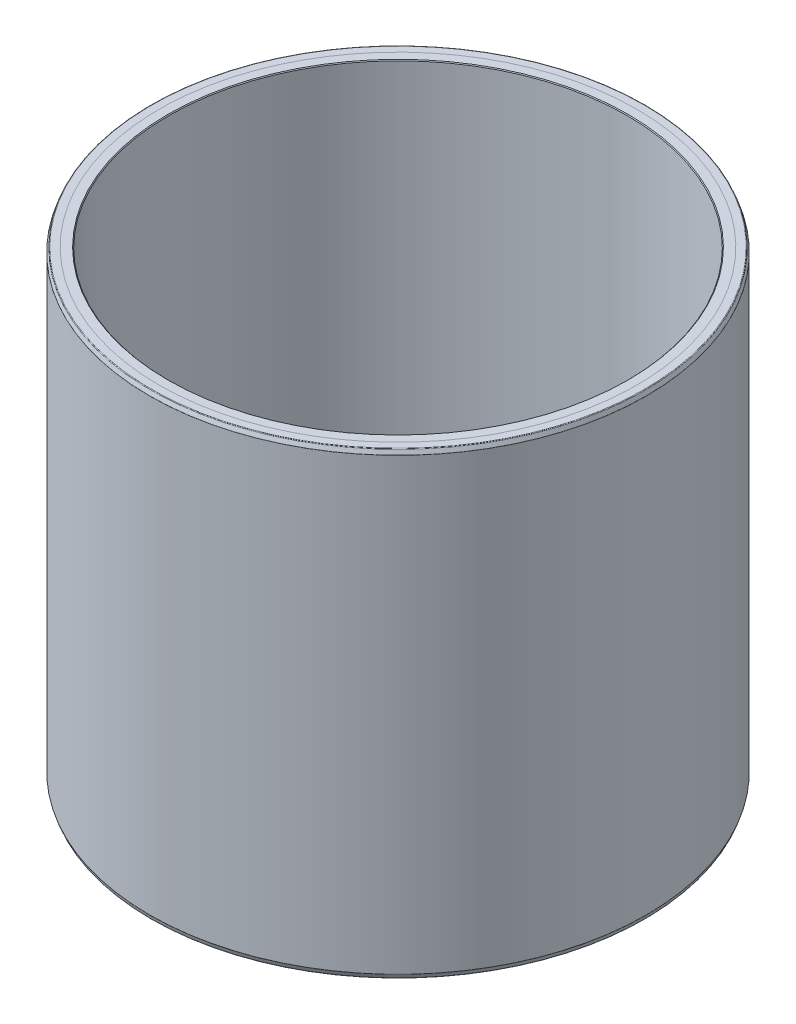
ISO-10303-21;
HEADER;
FILE_DESCRIPTION(('STEP AP214'),'2;1');
FILE_NAME('part.step','',(''),(''),'','','');
FILE_SCHEMA(('AUTOMOTIVE_DESIGN { 1 0 10303 214 1 1 1 1 }'));
ENDSEC;
DATA;
#1=APPLICATION_CONTEXT('core data for automotive mechanical design processes');
#2=APPLICATION_PROTOCOL_DEFINITION('international standard','automotive_design',2000,#1);
#3=PRODUCT_CONTEXT('',#1,'mechanical');
#4=PRODUCT('Part','Part','',(#3));
#5=PRODUCT_RELATED_PRODUCT_CATEGORY('part','',(#4));
#6=PRODUCT_DEFINITION_FORMATION('','',#4);
#7=PRODUCT_DEFINITION_CONTEXT('part definition',#1,'design');
#8=PRODUCT_DEFINITION('design','',#6,#7);
#9=PRODUCT_DEFINITION_SHAPE('','',#8);
#10=(LENGTH_UNIT() NAMED_UNIT(*) SI_UNIT(.MILLI.,.METRE.));
#11=(NAMED_UNIT(*) PLANE_ANGLE_UNIT() SI_UNIT($,.RADIAN.));
#12=(NAMED_UNIT(*) SI_UNIT($,.STERADIAN.) SOLID_ANGLE_UNIT());
#13=UNCERTAINTY_MEASURE_WITH_UNIT(LENGTH_MEASURE(1.E-05),#10,'distance_accuracy_value','');
#14=(GEOMETRIC_REPRESENTATION_CONTEXT(3) GLOBAL_UNCERTAINTY_ASSIGNED_CONTEXT((#13)) GLOBAL_UNIT_ASSIGNED_CONTEXT((#10,
#11,#12)) REPRESENTATION_CONTEXT('',''));
#15=CARTESIAN_POINT('',(0.,0.,0.));
#16=DIRECTION('',(0.,0.,1.));
#17=DIRECTION('',(1.,0.,0.));
#18=AXIS2_PLACEMENT_3D('',#15,#16,#17);
#19=CARTESIAN_POINT('',(76.2,76.2,0.));
#20=DIRECTION('',(0.,-1.,0.));
#21=DIRECTION('',(0.,0.,-1.));
#22=AXIS2_PLACEMENT_3D('',#19,#20,#21);
#23=PLANE('',#22);
#24=CARTESIAN_POINT('',(0.,76.2,0.));
#25=DIRECTION('',(0.,-1.,0.));
#26=DIRECTION('',(0.,0.,-1.));
#27=AXIS2_PLACEMENT_3D('',#24,#25,#26);
#28=CIRCLE('',#27,81.817456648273);
#29=CARTESIAN_POINT('',(0.,76.2,-81.817456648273));
#30=VERTEX_POINT('',#29);
#31=EDGE_CURVE('E51',#30,#30,#28,.F.);
#32=ORIENTED_EDGE('',*,*,#31,.T.);
#33=EDGE_LOOP('',(#32));
#34=FACE_BOUND('',#33,.T.);
#35=CARTESIAN_POINT('',(0.,76.2,0.));
#36=DIRECTION('',(0.,-1.,0.));
#37=DIRECTION('',(0.,0.,-1.));
#38=AXIS2_PLACEMENT_3D('',#35,#36,#37);
#39=CIRCLE('',#38,79.375);
#40=CARTESIAN_POINT('',(0.,76.2,-79.375));
#41=VERTEX_POINT('',#40);
#42=EDGE_CURVE('E72',#41,#41,#39,.F.);
#43=ORIENTED_EDGE('',*,*,#42,.F.);
#44=EDGE_LOOP('',(#43));
#45=FACE_BOUND('',#44,.T.);
#46=ADVANCED_FACE('F40',(#34,#45),#23,.F.);
#47=CARTESIAN_POINT('',(0.,85.852,0.));
#48=DIRECTION('',(0.,1.,0.));
#49=DIRECTION('',(0.,0.,1.));
#50=AXIS2_PLACEMENT_3D('',#47,#48,#49);
#51=CYLINDRICAL_SURFACE('',#50,82.55);
#52=CARTESIAN_POINT('',(0.,-74.6312129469,0.));
#53=DIRECTION('',(0.,-1.,0.));
#54=DIRECTION('',(0.,0.,-1.));
#55=AXIS2_PLACEMENT_3D('',#52,#53,#54);
#56=CIRCLE('',#55,82.55);
#57=CARTESIAN_POINT('',(0.,-74.6312129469,-82.55));
#58=VERTEX_POINT('',#57);
#59=EDGE_CURVE('E66',#58,#58,#56,.F.);
#60=ORIENTED_EDGE('',*,*,#59,.T.);
#61=EDGE_LOOP('',(#60));
#62=FACE_BOUND('',#61,.T.);
#63=CARTESIAN_POINT('',(0.,74.6312129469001,0.));
#64=DIRECTION('',(0.,1.,0.));
#65=DIRECTION('',(0.,0.,1.));
#66=AXIS2_PLACEMENT_3D('',#63,#64,#65);
#67=CIRCLE('',#66,82.55);
#68=CARTESIAN_POINT('',(0.,74.6312129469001,82.55));
#69=VERTEX_POINT('',#68);
#70=EDGE_CURVE('E69',#69,#69,#67,.F.);
#71=ORIENTED_EDGE('',*,*,#70,.T.);
#72=EDGE_LOOP('',(#71));
#73=FACE_BOUND('',#72,.T.);
#74=ADVANCED_FACE('F42',(#62,#73),#51,.T.);
#75=ORIENTED_EDGE('',*,*,#42,.T.);
#76=EDGE_LOOP('',(#75));
#77=FACE_BOUND('',#76,.T.);
#78=CARTESIAN_POINT('',(0.,76.2,0.));
#79=DIRECTION('',(0.,-1.,0.));
#80=DIRECTION('',(0.,0.,-1.));
#81=AXIS2_PLACEMENT_3D('',#78,#79,#80);
#82=CIRCLE('',#81,76.454);
#83=CARTESIAN_POINT('',(0.,76.2,-76.454));
#84=VERTEX_POINT('',#83);
#85=EDGE_CURVE('E79',#84,#84,#82,.T.);
#86=ORIENTED_EDGE('',*,*,#85,.T.);
#87=EDGE_LOOP('',(#86));
#88=FACE_BOUND('',#87,.T.);
#89=ADVANCED_FACE('F109',(#77,#88),#23,.F.);
#90=CARTESIAN_POINT('',(0.,85.852,0.));
#91=DIRECTION('',(0.,1.,0.));
#92=DIRECTION('',(0.,0.,1.));
#93=AXIS2_PLACEMENT_3D('',#90,#91,#92);
#94=CYLINDRICAL_SURFACE('',#93,76.2);
#95=CARTESIAN_POINT('',(0.,75.946,0.));
#96=DIRECTION('',(0.,-1.,0.));
#97=DIRECTION('',(0.,0.,-1.));
#98=AXIS2_PLACEMENT_3D('',#95,#96,#97);
#99=CIRCLE('',#98,76.2);
#100=CARTESIAN_POINT('',(0.,75.946,-76.2));
#101=VERTEX_POINT('',#100);
#102=EDGE_CURVE('E82',#101,#101,#99,.F.);
#103=ORIENTED_EDGE('',*,*,#102,.T.);
#104=EDGE_LOOP('',(#103));
#105=FACE_BOUND('',#104,.T.);
#106=CARTESIAN_POINT('',(0.,-75.946,0.));
#107=DIRECTION('',(0.,1.,0.));
#108=DIRECTION('',(0.,0.,1.));
#109=AXIS2_PLACEMENT_3D('',#106,#107,#108);
#110=CIRCLE('',#109,76.2);
#111=CARTESIAN_POINT('',(0.,-75.946,76.2));
#112=VERTEX_POINT('',#111);
#113=EDGE_CURVE('E85',#112,#112,#110,.F.);
#114=ORIENTED_EDGE('',*,*,#113,.T.);
#115=EDGE_LOOP('',(#114));
#116=FACE_BOUND('',#115,.T.);
#117=ADVANCED_FACE('F89',(#105,#116),#94,.F.);
#118=CARTESIAN_POINT('',(76.2,-76.2,0.));
#119=DIRECTION('',(0.,1.,0.));
#120=DIRECTION('',(0.,0.,1.));
#121=AXIS2_PLACEMENT_3D('',#118,#119,#120);
#122=PLANE('',#121);
#123=CARTESIAN_POINT('',(0.,-76.2,0.));
#124=DIRECTION('',(0.,1.,0.));
#125=DIRECTION('',(0.,0.,1.));
#126=AXIS2_PLACEMENT_3D('',#123,#124,#125);
#127=CIRCLE('',#126,81.817456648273);
#128=CARTESIAN_POINT('',(0.,-76.2,81.817456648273));
#129=VERTEX_POINT('',#128);
#130=EDGE_CURVE('E55',#129,#129,#127,.F.);
#131=ORIENTED_EDGE('',*,*,#130,.T.);
#132=EDGE_LOOP('',(#131));
#133=FACE_BOUND('',#132,.T.);
#134=CARTESIAN_POINT('',(0.,-76.2,0.));
#135=DIRECTION('',(0.,1.,0.));
#136=DIRECTION('',(0.,0.,1.));
#137=AXIS2_PLACEMENT_3D('',#134,#135,#136);
#138=CIRCLE('',#137,76.4540000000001);
#139=CARTESIAN_POINT('',(0.,-76.2,76.4540000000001));
#140=VERTEX_POINT('',#139);
#141=EDGE_CURVE('E76',#140,#140,#138,.T.);
#142=ORIENTED_EDGE('',*,*,#141,.T.);
#143=EDGE_LOOP('',(#142));
#144=FACE_BOUND('',#143,.T.);
#145=ADVANCED_FACE('F99',(#133,#144),#122,.F.);
#146=CARTESIAN_POINT('',(0.,75.946,0.));
#147=DIRECTION('',(0.,1.,0.));
#148=DIRECTION('',(0.,0.,1.));
#149=AXIS2_PLACEMENT_3D('',#146,#147,#148);
#150=CONICAL_SURFACE('',#149,76.2,0.785398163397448);
#151=ORIENTED_EDGE('',*,*,#85,.F.);
#152=EDGE_LOOP('',(#151));
#153=FACE_BOUND('',#152,.T.);
#154=ORIENTED_EDGE('',*,*,#102,.F.);
#155=EDGE_LOOP('',(#154));
#156=FACE_BOUND('',#155,.T.);
#157=ADVANCED_FACE('F95',(#153,#156),#150,.F.);
#158=CARTESIAN_POINT('',(0.,-76.2,0.));
#159=DIRECTION('',(0.,-1.,0.));
#160=DIRECTION('',(0.,0.,-1.));
#161=AXIS2_PLACEMENT_3D('',#158,#159,#160);
#162=CONICAL_SURFACE('',#161,76.4540000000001,0.785398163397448);
#163=ORIENTED_EDGE('',*,*,#113,.F.);
#164=EDGE_LOOP('',(#163));
#165=FACE_BOUND('',#164,.T.);
#166=ORIENTED_EDGE('',*,*,#141,.F.);
#167=EDGE_LOOP('',(#166));
#168=FACE_BOUND('',#167,.T.);
#169=ADVANCED_FACE('F91',(#165,#168),#162,.F.);
#170=CARTESIAN_POINT('',(0.,76.2,0.));
#171=DIRECTION('',(0.,-1.,0.));
#172=DIRECTION('',(0.,0.,-1.));
#173=AXIS2_PLACEMENT_3D('',#170,#171,#172);
#174=CONICAL_SURFACE('',#173,81.9953093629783,0.349065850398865);
#175=CARTESIAN_POINT('',(0.,76.0328731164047,0.));
#176=DIRECTION('',(0.,-1.,0.));
#177=DIRECTION('',(0.,0.,-1.));
#178=AXIS2_PLACEMENT_3D('',#175,#176,#177);
#179=CIRCLE('',#178,82.0561385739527);
#180=CARTESIAN_POINT('',(0.,76.0328731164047,-82.0561385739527));
#181=VERTEX_POINT('',#180);
#182=EDGE_CURVE('E10',#181,#181,#179,.T.);
#183=ORIENTED_EDGE('',*,*,#182,.T.);
#184=EDGE_LOOP('',(#183));
#185=FACE_BOUND('',#184,.T.);
#186=CARTESIAN_POINT('',(0.,74.7180860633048,0.));
#187=DIRECTION('',(0.,-1.,0.));
#188=DIRECTION('',(0.,0.,-1.));
#189=AXIS2_PLACEMENT_3D('',#186,#187,#188);
#190=CIRCLE('',#189,82.5346819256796);
#191=CARTESIAN_POINT('',(0.,74.7180860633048,-82.5346819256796));
#192=VERTEX_POINT('',#191);
#193=EDGE_CURVE('E47',#192,#192,#190,.F.);
#194=ORIENTED_EDGE('',*,*,#193,.T.);
#195=EDGE_LOOP('',(#194));
#196=FACE_BOUND('',#195,.T.);
#197=ADVANCED_FACE('F94',(#185,#196),#174,.T.);
#198=CARTESIAN_POINT('',(0.,-74.6759999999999,0.));
#199=DIRECTION('',(0.,1.,0.));
#200=DIRECTION('',(0.,0.,1.));
#201=AXIS2_PLACEMENT_3D('',#198,#199,#200);
#202=CONICAL_SURFACE('',#201,82.55,0.349065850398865);
#203=CARTESIAN_POINT('',(0.,-74.7180860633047,0.));
#204=DIRECTION('',(0.,1.,0.));
#205=DIRECTION('',(0.,0.,1.));
#206=AXIS2_PLACEMENT_3D('',#203,#204,#205);
#207=CIRCLE('',#206,82.5346819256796);
#208=CARTESIAN_POINT('',(0.,-74.7180860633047,82.5346819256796));
#209=VERTEX_POINT('',#208);
#210=EDGE_CURVE('E60',#209,#209,#207,.F.);
#211=ORIENTED_EDGE('',*,*,#210,.T.);
#212=EDGE_LOOP('',(#211));
#213=FACE_BOUND('',#212,.T.);
#214=CARTESIAN_POINT('',(0.,-76.0328731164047,0.));
#215=DIRECTION('',(0.,1.,0.));
#216=DIRECTION('',(0.,0.,1.));
#217=AXIS2_PLACEMENT_3D('',#214,#215,#216);
#218=CIRCLE('',#217,82.0561385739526);
#219=CARTESIAN_POINT('',(0.,-76.0328731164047,82.0561385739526));
#220=VERTEX_POINT('',#219);
#221=EDGE_CURVE('E63',#220,#220,#218,.T.);
#222=ORIENTED_EDGE('',*,*,#221,.T.);
#223=EDGE_LOOP('',(#222));
#224=FACE_BOUND('',#223,.T.);
#225=ADVANCED_FACE('F160',(#213,#224),#202,.T.);
#226=CARTESIAN_POINT('',(0.,-74.6312129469,0.));
#227=DIRECTION('',(0.,-1.,0.));
#228=DIRECTION('',(0.,0.,-1.));
#229=AXIS2_PLACEMENT_3D('',#226,#227,#228);
#230=TOROIDAL_SURFACE('',#229,82.296,0.254);
#231=ORIENTED_EDGE('',*,*,#210,.F.);
#232=EDGE_LOOP('',(#231));
#233=FACE_BOUND('',#232,.T.);
#234=ORIENTED_EDGE('',*,*,#59,.F.);
#235=EDGE_LOOP('',(#234));
#236=FACE_BOUND('',#235,.T.);
#237=ADVANCED_FACE('F169',(#233,#236),#230,.T.);
#238=CARTESIAN_POINT('',(0.,-75.946,0.));
#239=DIRECTION('',(0.,1.,0.));
#240=DIRECTION('',(0.,0.,1.));
#241=AXIS2_PLACEMENT_3D('',#238,#239,#240);
#242=TOROIDAL_SURFACE('',#241,81.817456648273,0.254);
#243=ORIENTED_EDGE('',*,*,#221,.F.);
#244=EDGE_LOOP('',(#243));
#245=FACE_BOUND('',#244,.T.);
#246=ORIENTED_EDGE('',*,*,#130,.F.);
#247=EDGE_LOOP('',(#246));
#248=FACE_BOUND('',#247,.T.);
#249=ADVANCED_FACE('F179',(#245,#248),#242,.T.);
#250=CARTESIAN_POINT('',(0.,75.946,0.));
#251=DIRECTION('',(0.,-1.,0.));
#252=DIRECTION('',(0.,0.,-1.));
#253=AXIS2_PLACEMENT_3D('',#250,#251,#252);
#254=TOROIDAL_SURFACE('',#253,81.817456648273,0.254);
#255=ORIENTED_EDGE('',*,*,#182,.F.);
#256=EDGE_LOOP('',(#255));
#257=FACE_BOUND('',#256,.T.);
#258=ORIENTED_EDGE('',*,*,#31,.F.);
#259=EDGE_LOOP('',(#258));
#260=FACE_BOUND('',#259,.T.);
#261=ADVANCED_FACE('F189',(#257,#260),#254,.T.);
#262=CARTESIAN_POINT('',(0.,74.6312129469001,0.));
#263=DIRECTION('',(0.,1.,0.));
#264=DIRECTION('',(0.,0.,1.));
#265=AXIS2_PLACEMENT_3D('',#262,#263,#264);
#266=TOROIDAL_SURFACE('',#265,82.296,0.254);
#267=ORIENTED_EDGE('',*,*,#193,.F.);
#268=EDGE_LOOP('',(#267));
#269=FACE_BOUND('',#268,.T.);
#270=ORIENTED_EDGE('',*,*,#70,.F.);
#271=EDGE_LOOP('',(#270));
#272=FACE_BOUND('',#271,.T.);
#273=ADVANCED_FACE('F199',(#269,#272),#266,.T.);
#274=CLOSED_SHELL('',(#46,#74,#89,#117,#145,#157,#169,#197,#225,#237,#249,#261,#273));
#275=MANIFOLD_SOLID_BREP('B2',#274);
#276=ADVANCED_BREP_SHAPE_REPRESENTATION('',(#18,#275),#14);
#277=SHAPE_DEFINITION_REPRESENTATION(#9,#276);
ENDSEC;
END-ISO-10303-21;
